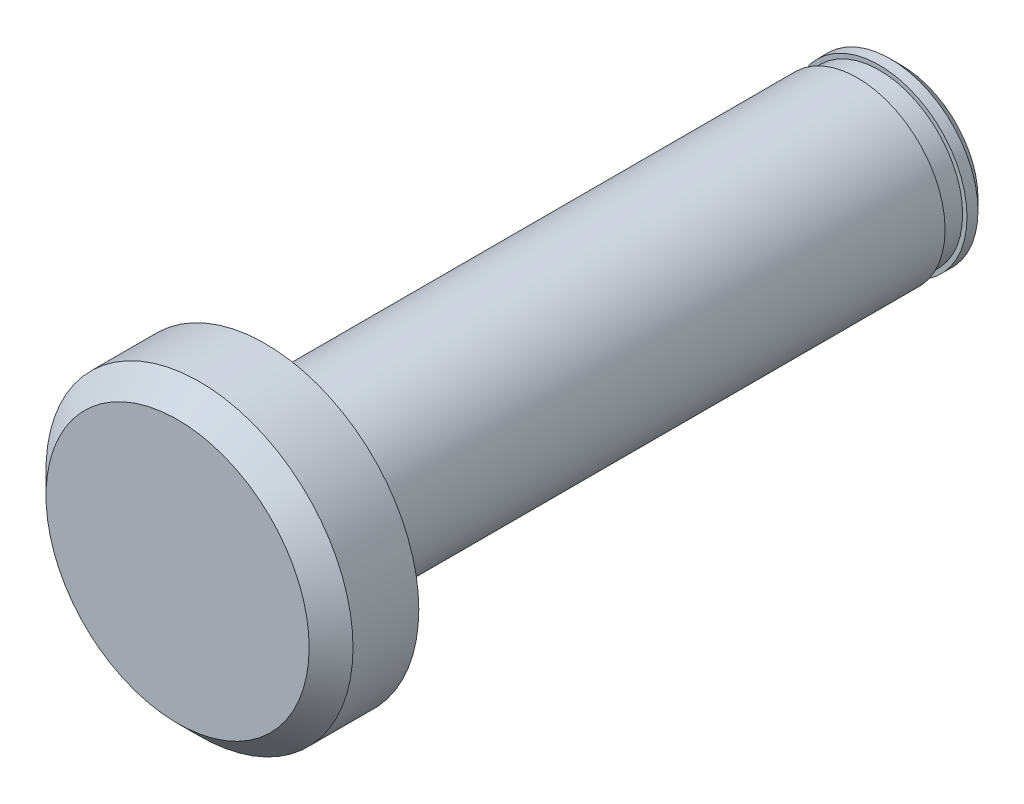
from build123d import *


with BuildPart() as part:
    # Esquisse3 → Base-R_volution (revolve)
    with BuildSketch(Plane(origin=(0, 0, 0), x_dir=(1, 0, 0), z_dir=(0, 1, 0)), mode=Mode.PRIVATE) as base_r_volution_sk:
        Polygon((-14.488580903, -38.951150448), (-8.488580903, -38.951150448), (-8.488580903, -5.951150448), (-11.988580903, -5.951150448), (-12.488580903, -6.451150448), (-12.488580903, -6.951150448), (-12.288580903, -6.951150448), (-12.288580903, -7.951150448), (-12.488580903, -7.951150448), (-12.488580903, -34.951150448), (-15.488580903, -34.951150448), (-15.488580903, -37.951150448), align=None)
    revolve(base_r_volution_sk.sketch.rotate(Axis((-8.488580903, 0, 56.293331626), (0, 0, -1)), 180), axis=Axis((-8.488580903, 0, 56.293331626), (0, 0, -1)))


solid = part.part
